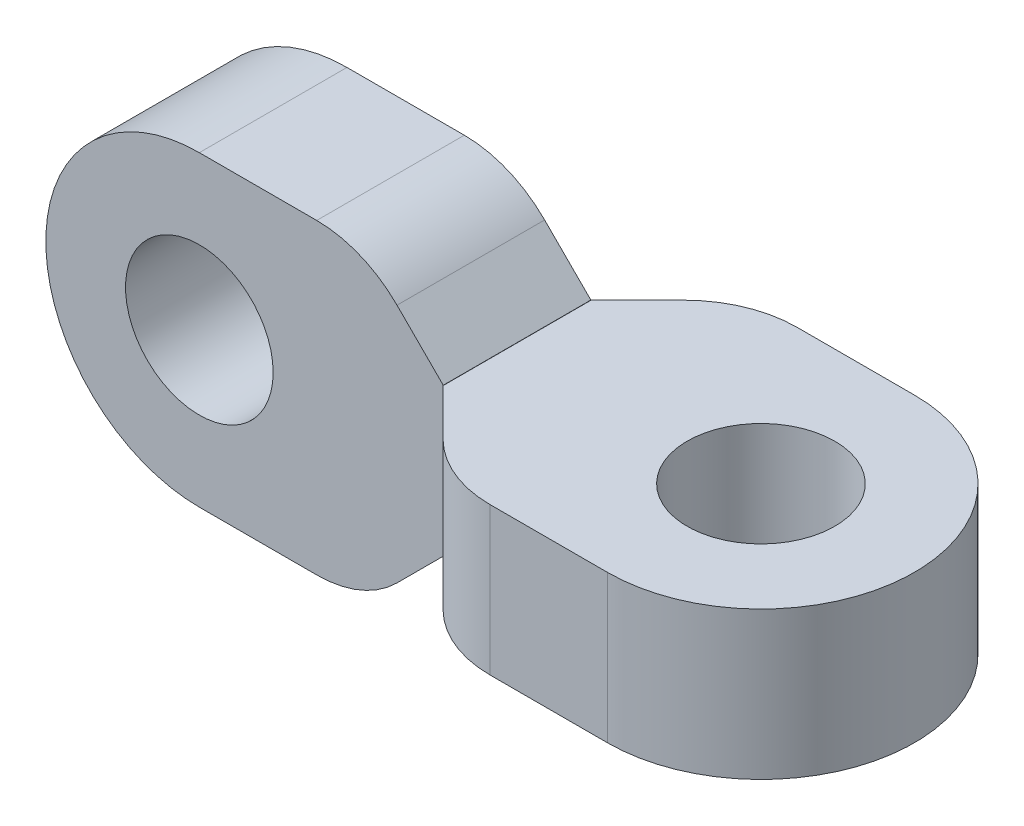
from build123d import *

# Parameters (mm, degrees)
SKETCH1_R      = 4.1275
EXTRUDE1_DEPTH = 4.1275
SKETCH3_R      = 4.1275
EXTRUDE2_DEPTH = 4.1275
CHAMFER1_SIZE  = 4.445
FILLET2_R      = 6.35


with BuildPart() as part:
    # Sketch1 → Extrude1 (new, symmetric)
    with BuildSketch(Plane.XY):
        with BuildLine():
            Line((0, -8.5852), (13.6398, -8.5852))
            Line((13.6398, -8.5852), (13.6398, 8.5852))
            Line((13.6398, 8.5852), (0, 8.5852))
            ThreePointArc((0, 8.5852), (-8.5852, 0), (0, -8.5852))
        make_face()
        Circle(SKETCH1_R, mode=Mode.SUBTRACT)
    extrude(amount=EXTRUDE1_DEPTH, both=True)

    # Sketch3 → Extrude2 (add, symmetric)
    with BuildSketch(Plane(origin=(27.2796, 0, 0), x_dir=(-1, 0, 0), z_dir=(0, -1, 0))):
        with BuildLine():
            Line((0, -8.5852), (13.6398, -8.5852))
            Line((13.6398, -8.5852), (13.6398, 8.5852))
            Line((13.6398, 8.5852), (0, 8.5852))
            ThreePointArc((0, 8.5852), (-8.5852, 0), (0, -8.5852))
        make_face()
        with Locations(Location((0, 0, 0), (0, 0, 90))):
            Circle(SKETCH3_R, mode=Mode.SUBTRACT)
    extrude(amount=EXTRUDE2_DEPTH, both=True)

    # Chamfer1
    chamfer1_edges = [part.edges().sort_by_distance(p)[0] for p in [
        (13.6398, 0, 8.5852),
        (13.6398, 0, -8.5852),
        (13.6398, 8.5852, 0),
        (13.6398, -8.5852, 0),
    ]]
    chamfer(chamfer1_edges, length=CHAMFER1_SIZE)

    # Fillet2
    fillet2_edges = [part.edges().sort_by_distance(p)[0] for p in [
        (18.0848, 0, 8.5852),
        (9.1948, 8.5852, 0),
        (18.0848, 0, -8.5852),
        (9.1948, -8.5852, 0),
    ]]
    fillet(fillet2_edges, radius=FILLET2_R)


solid = part.part
